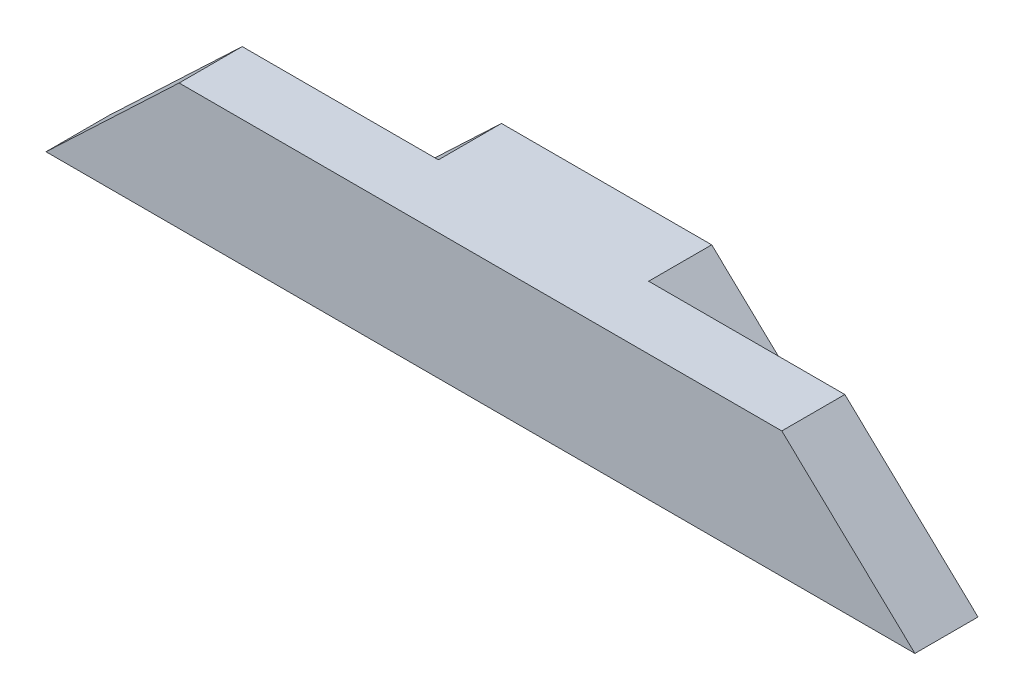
from build123d import *

# Parameters (mm, degrees)
ESQUISSE1_W             = 62
ESQUISSE1_H             = 9
EXTRUSION1_DEPTH        = 9
ENL_V_MAT_EXTRU_2_DEPTH = 9
ENL_V_MAT_EXTRU_3_DEPTH = 4.5


with BuildPart() as part:
    # Esquisse1 → Extrusion1 (new body)
    with BuildSketch(Plane.XY):
        with Locations((31, 4.5)):
            Rectangle(ESQUISSE1_W, ESQUISSE1_H)
    extrude(amount=EXTRUSION1_DEPTH)

    # Esquisse2 → Enl_v. mat.-Extru.2 (cut)
    with BuildSketch(Plane.XY.offset(9)):
        Polygon((62, 9), (52.5, 9), (62, 0), align=None)
        Polygon((0, 9), (9.5, 9), (0, 0), align=None)
    extrude(amount=-ENL_V_MAT_EXTRU_2_DEPTH, mode=Mode.SUBTRACT)

    # Esquisse3 → Enl_v. mat.-Extru.3 (cut)
    with BuildSketch(Plane(origin=(0, 0, 0), x_dir=(-1, 0, 0), z_dir=(0, 0, -1))):
        Polygon((-9.5, 9), (-23.5, 9), (-14, 0), (0, 0), align=None)
        Polygon((-52.5, 9), (-38.5, 9), (-48, 0), (-62, 0), align=None)
    extrude(amount=-ENL_V_MAT_EXTRU_3_DEPTH, mode=Mode.SUBTRACT)


solid = part.part
